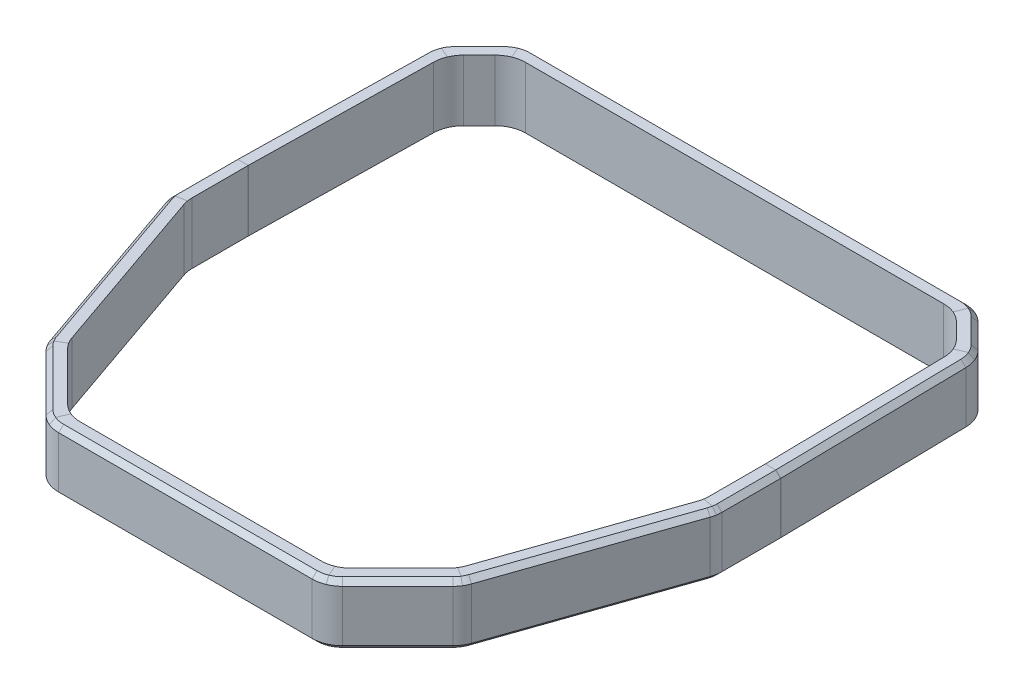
from build123d import *

# Parameters (mm, degrees)
SKETCH1_W     = 1.5875
SKETCH1_H     = 6.35
FILLET1_R     = 3.175
CHAMFER1_SIZE = 0.508


with BuildPart() as part:
    # Sweep1: sweep along a path in Sketch2
    with BuildLine(Plane(origin=(0, 0, 0), x_dir=(1, 0, 0), z_dir=(0, 1, 0))) as sweep1_path:
        Line((0, 0), (-27.6098, 0))
        Line((-27.6098, 0), (-34.045051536, 6.435251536))
        Line((-34.045051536, 6.435251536), (-40.6273, 25.4))
        Line((-40.6273, 25.4), (-40.6273, 31.75))
        Line((-40.6273, 31.75), (-40.270978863, 51.933561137))
        Line((-40.270978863, 51.933561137), (-36.8046, 55.39994))
        Line((-36.8046, 55.39994), (9.1948, 55.39994))
        Line((9.1948, 55.39994), (12.661178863, 51.933561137))
        Line((12.661178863, 51.933561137), (13.0175, 31.75))
        Line((13.0175, 31.75), (13.0175, 25.4))
        Line((13.0175, 25.4), (6.435251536, 6.435251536))
        Line((6.435251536, 6.435251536), (0, 0))
    # Sketch1 → Sweep1 (sweep)
    with BuildSketch(Plane(origin=(0, 0, 0), x_dir=(0, 0, -1), z_dir=(1, 0, 0))):
        with Locations((-0.79375, -3.175)):
            Rectangle(SKETCH1_W, SKETCH1_H)
    sweep(path=sweep1_path.line, transition=Transition.RIGHT)

    # Fillet1
    fillet1_edges = [part.edges().sort_by_distance(p)[0] for p in [
        (7.815488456, -3.175, -5.570424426),
        (6.435251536, -3.175, -6.435251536),
        (-42.2148, -3.175, -25.132338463),
        (-40.6273, -3.175, -25.4),
        (-27.6098, -3.175, 0),
        (14.605, -3.175, -25.132338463),
        (13.0175, -3.175, -25.4),
        (-42.2148, -3.175, -31.764011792),
        (-28.26736403, -3.175, 1.5875),
        (-40.6273, -3.175, -31.75),
        (0.65756403, -3.175, 1.5875),
        (0, -3.175, 0),
        (14.605, -3.175, -31.764011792),
        (13.0175, -3.175, -31.75),
        (-41.846913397, -3.175, -52.602690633),
        (-40.270978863, -3.175, -51.933561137),
        (14.237113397, -3.175, -52.602690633),
        (12.661178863, -3.175, -51.933561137),
        (-37.46216403, -3.175, -56.98744),
        (-36.8046, -3.175, -55.39994),
        (9.85236403, -3.175, -56.98744),
        (9.1948, -3.175, -55.39994),
        (-35.425288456, -3.175, -5.570424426),
        (-34.045051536, -3.175, -6.435251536),
    ]]
    fillet(fillet1_edges, radius=FILLET1_R)

    # Chamfer1
    chamfer1_edges = [part.edges().sort_by_distance(p)[0] for p in [
        (-39.666104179, -6.35, -54.783499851),
        (-39.666104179, 0, -54.783499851),
        (-37.362055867, 0, -56.745757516),
        (-41.617523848, 0, -52.505293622),
        (-42.042174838, 0, -41.542243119),
        (-42.042174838, 0, -41.542243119),
        (-41.617523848, 0, -52.505293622),
        (-42.042174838, -6.35, -41.542243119),
        (-42.042174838, -6.35, -41.542243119),
        (-41.617523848, -6.35, -52.505293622),
        (-37.362055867, -6.35, -56.745757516),
        (-41.617523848, -6.35, -52.505293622),
        (-42.2148, 0, -28.715836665),
        (-42.170610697, 0, -25.139789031),
        (-42.2148, 0, -28.715836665),
        (-42.2148, -6.35, -28.715836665),
        (-42.170610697, -6.35, -25.139789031),
        (-42.2148, -6.35, -28.715836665),
        (-38.851780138, 0, -15.442818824),
        (-35.355298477, 0, -5.614278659),
        (-42.170610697, 0, -25.139789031),
        (-38.851780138, -6.35, -15.442818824),
        (-35.355298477, -6.35, -5.614278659),
        (-42.170610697, -6.35, -25.139789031),
        (-32.053589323, 0, -2.198725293),
        (-28.167255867, 0, 1.345817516),
        (-35.355298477, 0, -5.614278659),
        (-32.053589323, -6.35, -2.198725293),
        (-28.167255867, -6.35, 1.345817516),
        (-35.355298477, -6.35, -5.614278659),
        (-13.8049, -6.35, -56.98744),
        (-13.8049, 0, -56.98744),
        (9.752255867, 0, -56.745757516),
        (-37.362055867, 0, -56.745757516),
        (9.752255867, -6.35, -56.745757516),
        (-37.362055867, -6.35, -56.745757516),
        (12.056304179, -6.35, -54.783499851),
        (12.056304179, 0, -54.783499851),
        (14.007723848, 0, -52.505293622),
        (9.752255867, 0, -56.745757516),
        (14.007723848, -6.35, -52.505293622),
        (9.752255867, -6.35, -56.745757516),
        (14.605, -6.35, -28.715836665),
        (14.605, 0, -28.715836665),
        (14.560810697, 0, -25.139789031),
        (14.605, 0, -28.715836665),
        (14.432374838, 0, -41.542243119),
        (14.007723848, 0, -52.505293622),
        (14.432374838, 0, -41.542243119),
        (14.432374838, -6.35, -41.542243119),
        (14.007723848, -6.35, -52.505293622),
        (14.432374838, -6.35, -41.542243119),
        (14.560810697, -6.35, -25.139789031),
        (14.605, -6.35, -28.715836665),
        (11.241980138, -6.35, -15.442818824),
        (11.241980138, 0, -15.442818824),
        (7.745498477, 0, -5.614278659),
        (14.560810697, 0, -25.139789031),
        (7.745498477, -6.35, -5.614278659),
        (14.560810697, -6.35, -25.139789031),
        (4.443789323, -6.35, -2.198725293),
        (4.443789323, 0, -2.198725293),
        (0.557455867, 0, 1.345817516),
        (7.745498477, 0, -5.614278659),
        (0.557455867, -6.35, 1.345817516),
        (7.745498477, -6.35, -5.614278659),
        (-13.8049, 0, 1.5875),
        (-13.8049, -6.35, 1.5875),
        (-28.167255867, 0, 1.345817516),
        (0.557455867, 0, 1.345817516),
        (-28.167255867, -6.35, 1.345817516),
        (0.557455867, -6.35, 1.345817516),
    ]]
    chamfer(chamfer1_edges, length=CHAMFER1_SIZE)


solid = part.part
